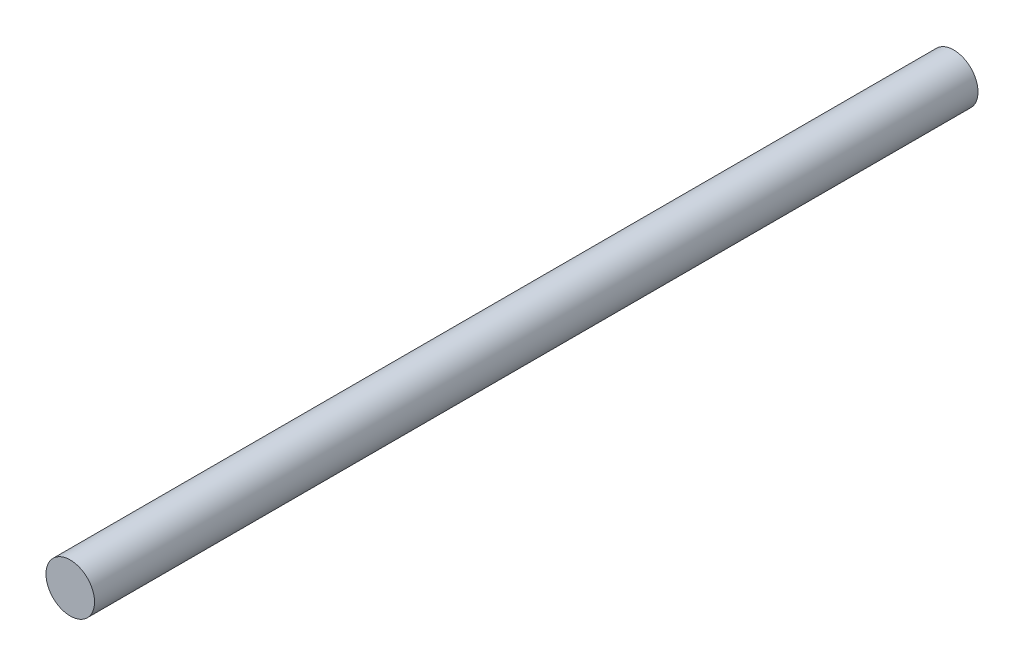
ISO-10303-21;
HEADER;
FILE_DESCRIPTION(('STEP AP214'),'2;1');
FILE_NAME('part.step','',(''),(''),'','','');
FILE_SCHEMA(('AUTOMOTIVE_DESIGN { 1 0 10303 214 1 1 1 1 }'));
ENDSEC;
DATA;
#1=APPLICATION_CONTEXT('core data for automotive mechanical design processes');
#2=APPLICATION_PROTOCOL_DEFINITION('international standard','automotive_design',2000,#1);
#3=PRODUCT_CONTEXT('',#1,'mechanical');
#4=PRODUCT('Part','Part','',(#3));
#5=PRODUCT_RELATED_PRODUCT_CATEGORY('part','',(#4));
#6=PRODUCT_DEFINITION_FORMATION('','',#4);
#7=PRODUCT_DEFINITION_CONTEXT('part definition',#1,'design');
#8=PRODUCT_DEFINITION('design','',#6,#7);
#9=PRODUCT_DEFINITION_SHAPE('','',#8);
#10=(LENGTH_UNIT() NAMED_UNIT(*) SI_UNIT(.MILLI.,.METRE.));
#11=(NAMED_UNIT(*) PLANE_ANGLE_UNIT() SI_UNIT($,.RADIAN.));
#12=(NAMED_UNIT(*) SI_UNIT($,.STERADIAN.) SOLID_ANGLE_UNIT());
#13=UNCERTAINTY_MEASURE_WITH_UNIT(LENGTH_MEASURE(1.E-05),#10,'distance_accuracy_value','');
#14=(GEOMETRIC_REPRESENTATION_CONTEXT(3) GLOBAL_UNCERTAINTY_ASSIGNED_CONTEXT((#13)) GLOBAL_UNIT_ASSIGNED_CONTEXT((#10,
#11,#12)) REPRESENTATION_CONTEXT('',''));
#15=CARTESIAN_POINT('',(0.,0.,0.));
#16=DIRECTION('',(0.,0.,1.));
#17=DIRECTION('',(1.,0.,0.));
#18=AXIS2_PLACEMENT_3D('',#15,#16,#17);
#19=CARTESIAN_POINT('',(0.,0.,50.));
#20=DIRECTION('',(0.,0.,-1.));
#21=DIRECTION('',(-1.,0.,0.));
#22=AXIS2_PLACEMENT_3D('',#19,#20,#21);
#23=CYLINDRICAL_SURFACE('',#22,2.75);
#24=CARTESIAN_POINT('',(0.,0.,50.));
#25=DIRECTION('',(0.,0.,1.));
#26=DIRECTION('',(1.,0.,0.));
#27=AXIS2_PLACEMENT_3D('',#24,#25,#26);
#28=CIRCLE('',#27,2.75);
#29=CARTESIAN_POINT('',(2.75,0.,50.));
#30=VERTEX_POINT('',#29);
#31=EDGE_CURVE('E10',#30,#30,#28,.T.);
#32=ORIENTED_EDGE('',*,*,#31,.F.);
#33=EDGE_LOOP('',(#32));
#34=FACE_BOUND('',#33,.T.);
#35=CARTESIAN_POINT('',(0.,0.,-50.));
#36=DIRECTION('',(0.,0.,1.));
#37=DIRECTION('',(1.,0.,0.));
#38=AXIS2_PLACEMENT_3D('',#35,#36,#37);
#39=CIRCLE('',#38,2.75);
#40=CARTESIAN_POINT('',(2.75,0.,-50.));
#41=VERTEX_POINT('',#40);
#42=EDGE_CURVE('E34',#41,#41,#39,.T.);
#43=ORIENTED_EDGE('',*,*,#42,.T.);
#44=EDGE_LOOP('',(#43));
#45=FACE_BOUND('',#44,.T.);
#46=ADVANCED_FACE('F31',(#34,#45),#23,.T.);
#47=CARTESIAN_POINT('',(0.,0.,50.));
#48=DIRECTION('',(0.,0.,1.));
#49=DIRECTION('',(1.,0.,0.));
#50=AXIS2_PLACEMENT_3D('',#47,#48,#49);
#51=PLANE('',#50);
#52=ORIENTED_EDGE('',*,*,#31,.T.);
#53=EDGE_LOOP('',(#52));
#54=FACE_BOUND('',#53,.T.);
#55=ADVANCED_FACE('F46',(#54),#51,.T.);
#56=CARTESIAN_POINT('',(0.,0.,-50.));
#57=DIRECTION('',(0.,0.,1.));
#58=DIRECTION('',(1.,0.,0.));
#59=AXIS2_PLACEMENT_3D('',#56,#57,#58);
#60=PLANE('',#59);
#61=ORIENTED_EDGE('',*,*,#42,.F.);
#62=EDGE_LOOP('',(#61));
#63=FACE_BOUND('',#62,.T.);
#64=ADVANCED_FACE('F44',(#63),#60,.F.);
#65=CLOSED_SHELL('',(#46,#55,#64));
#66=MANIFOLD_SOLID_BREP('B2',#65);
#67=ADVANCED_BREP_SHAPE_REPRESENTATION('',(#18,#66),#14);
#68=SHAPE_DEFINITION_REPRESENTATION(#9,#67);
ENDSEC;
END-ISO-10303-21;
